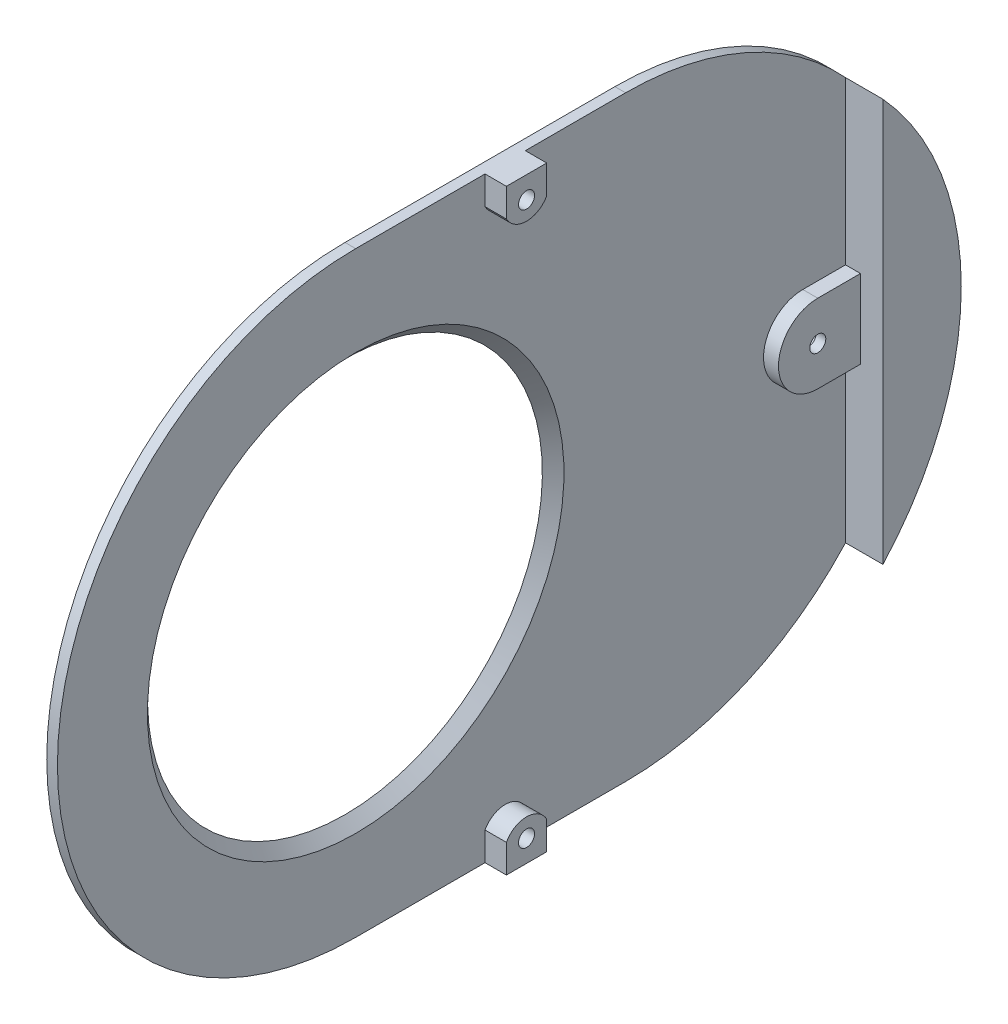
ISO-10303-21;
HEADER;
FILE_DESCRIPTION(('STEP AP214'),'2;1');
FILE_NAME('part.step','',(''),(''),'','','');
FILE_SCHEMA(('AUTOMOTIVE_DESIGN { 1 0 10303 214 1 1 1 1 }'));
ENDSEC;
DATA;
#1=APPLICATION_CONTEXT('core data for automotive mechanical design processes');
#2=APPLICATION_PROTOCOL_DEFINITION('international standard','automotive_design',2000,#1);
#3=PRODUCT_CONTEXT('',#1,'mechanical');
#4=PRODUCT('Part','Part','',(#3));
#5=PRODUCT_RELATED_PRODUCT_CATEGORY('part','',(#4));
#6=PRODUCT_DEFINITION_FORMATION('','',#4);
#7=PRODUCT_DEFINITION_CONTEXT('part definition',#1,'design');
#8=PRODUCT_DEFINITION('design','',#6,#7);
#9=PRODUCT_DEFINITION_SHAPE('','',#8);
#10=(LENGTH_UNIT() NAMED_UNIT(*) SI_UNIT(.MILLI.,.METRE.));
#11=(NAMED_UNIT(*) PLANE_ANGLE_UNIT() SI_UNIT($,.RADIAN.));
#12=(NAMED_UNIT(*) SI_UNIT($,.STERADIAN.) SOLID_ANGLE_UNIT());
#13=UNCERTAINTY_MEASURE_WITH_UNIT(LENGTH_MEASURE(1.E-05),#10,'distance_accuracy_value','');
#14=(GEOMETRIC_REPRESENTATION_CONTEXT(3) GLOBAL_UNCERTAINTY_ASSIGNED_CONTEXT((#13)) GLOBAL_UNIT_ASSIGNED_CONTEXT((#10,
#11,#12)) REPRESENTATION_CONTEXT('',''));
#15=CARTESIAN_POINT('',(0.,0.,0.));
#16=DIRECTION('',(0.,0.,1.));
#17=DIRECTION('',(1.,0.,0.));
#18=AXIS2_PLACEMENT_3D('',#15,#16,#17);
#19=CARTESIAN_POINT('',(-68.9,7.06668279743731,-66.1907413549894));
#20=DIRECTION('',(1.,0.,0.));
#21=DIRECTION('',(0.,1.,0.));
#22=AXIS2_PLACEMENT_3D('',#19,#20,#21);
#23=PLANE('',#22);
#24=CARTESIAN_POINT('',(-68.9,-50.9728934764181,-26.1696450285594));
#25=DIRECTION('',(-1.,0.,0.));
#26=DIRECTION('',(0.,-1.,0.));
#27=AXIS2_PLACEMENT_3D('',#24,#25,#26);
#28=CIRCLE('',#27,2.8);
#29=CARTESIAN_POINT('',(-68.9,-48.1728934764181,-26.1696450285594));
#30=VERTEX_POINT('',#29);
#31=EDGE_CURVE('E335',#30,#30,#28,.T.);
#32=ORIENTED_EDGE('',*,*,#31,.F.);
#33=EDGE_LOOP('',(#32));
#34=FACE_BOUND('',#33,.T.);
#35=CARTESIAN_POINT('',(-68.9,52.4551065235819,-26.1696450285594));
#36=DIRECTION('',(-1.,0.,0.));
#37=DIRECTION('',(0.,1.,0.));
#38=AXIS2_PLACEMENT_3D('',#35,#36,#37);
#39=CIRCLE('',#38,2.8);
#40=CARTESIAN_POINT('',(-68.9,49.6551065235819,-26.1696450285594));
#41=VERTEX_POINT('',#40);
#42=EDGE_CURVE('E382',#41,#41,#39,.T.);
#43=ORIENTED_EDGE('',*,*,#42,.F.);
#44=EDGE_LOOP('',(#43));
#45=FACE_BOUND('',#44,.T.);
#46=CARTESIAN_POINT('',(-68.9,0.741106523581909,-81.8452658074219));
#47=DIRECTION('',(-1.,0.,0.));
#48=DIRECTION('',(0.,-1.,0.));
#49=AXIS2_PLACEMENT_3D('',#46,#47,#48);
#50=CIRCLE('',#49,2.8);
#51=CARTESIAN_POINT('',(-68.9,3.54110652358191,-81.8452658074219));
#52=VERTEX_POINT('',#51);
#53=EDGE_CURVE('E365',#52,#52,#50,.T.);
#54=ORIENTED_EDGE('',*,*,#53,.F.);
#55=EDGE_LOOP('',(#54));
#56=FACE_BOUND('',#55,.T.);
#57=CARTESIAN_POINT('',(-68.9,0.741106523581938,1.79473419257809));
#58=DIRECTION('',(1.,0.,0.));
#59=DIRECTION('',(0.,-1.,0.));
#60=AXIS2_PLACEMENT_3D('',#57,#58,#59);
#61=CIRCLE('',#60,36.9219496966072);
#62=CARTESIAN_POINT('',(-68.9,-36.1808431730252,1.79473419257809));
#63=VERTEX_POINT('',#62);
#64=EDGE_CURVE('E27',#63,#63,#61,.T.);
#65=ORIENTED_EDGE('',*,*,#64,.T.);
#66=EDGE_LOOP('',(#65));
#67=FACE_BOUND('',#66,.T.);
#68=CARTESIAN_POINT('',(-68.9,0.741106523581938,-48.6952658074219));
#69=DIRECTION('',(1.,0.,0.));
#70=DIRECTION('',(0.,-1.,0.));
#71=AXIS2_PLACEMENT_3D('',#68,#69,#70);
#72=CIRCLE('',#71,55.794);
#73=CARTESIAN_POINT('',(-68.9,-55.0528934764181,-48.6952658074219));
#74=VERTEX_POINT('',#73);
#75=CARTESIAN_POINT('',(-68.9,56.5351065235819,-48.6952658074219));
#76=VERTEX_POINT('',#75);
#77=EDGE_CURVE('E11',#74,#76,#72,.T.);
#78=ORIENTED_EDGE('',*,*,#77,.F.);
#79=DIRECTION('',(0.,0.,-1.));
#80=VECTOR('',#79,1.);
#81=CARTESIAN_POINT('',(-68.9,-55.0528934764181,-10.8277658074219));
#82=LINE('',#81,#80);
#83=CARTESIAN_POINT('',(-68.9,-55.0528934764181,1.79473419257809));
#84=VERTEX_POINT('',#83);
#85=EDGE_CURVE('E404',#84,#74,#82,.T.);
#86=ORIENTED_EDGE('',*,*,#85,.F.);
#87=CARTESIAN_POINT('',(-68.9,0.741106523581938,1.79473419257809));
#88=DIRECTION('',(1.,0.,0.));
#89=DIRECTION('',(0.,-1.,0.));
#90=AXIS2_PLACEMENT_3D('',#87,#88,#89);
#91=CIRCLE('',#90,55.794);
#92=CARTESIAN_POINT('',(-68.9,56.5351065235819,1.79473419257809));
#93=VERTEX_POINT('',#92);
#94=EDGE_CURVE('E348',#93,#84,#91,.T.);
#95=ORIENTED_EDGE('',*,*,#94,.F.);
#96=DIRECTION('',(0.,0.,1.));
#97=VECTOR('',#96,1.);
#98=CARTESIAN_POINT('',(-68.9,56.5351065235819,-36.0727658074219));
#99=LINE('',#98,#97);
#100=EDGE_CURVE('E442',#76,#93,#99,.T.);
#101=ORIENTED_EDGE('',*,*,#100,.F.);
#102=EDGE_LOOP('',(#78,#86,#95,#101));
#103=FACE_BOUND('',#102,.T.);
#104=ADVANCED_FACE('F16',(#34,#45,#56,#67,#103),#23,.F.);
#105=CARTESIAN_POINT('',(-68.9,0.741106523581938,-48.6952658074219));
#106=DIRECTION('',(-1.,0.,0.));
#107=DIRECTION('',(0.,-1.,0.));
#108=AXIS2_PLACEMENT_3D('',#105,#106,#107);
#109=CYLINDRICAL_SURFACE('',#108,55.794);
#110=ORIENTED_EDGE('',*,*,#77,.T.);
#111=DIRECTION('',(-1.,0.,0.));
#112=VECTOR('',#111,1.);
#113=CARTESIAN_POINT('',(-66.9,56.5351065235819,-48.6952658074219));
#114=LINE('',#113,#112);
#115=CARTESIAN_POINT('',(-66.9,56.5351065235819,-48.6952658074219));
#116=VERTEX_POINT('',#115);
#117=EDGE_CURVE('E262',#116,#76,#114,.T.);
#118=ORIENTED_EDGE('',*,*,#117,.F.);
#119=CARTESIAN_POINT('',(-66.9,0.741106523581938,-48.6952658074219));
#120=DIRECTION('',(-1.,0.,0.));
#121=DIRECTION('',(0.,1.,0.));
#122=AXIS2_PLACEMENT_3D('',#119,#120,#121);
#123=CIRCLE('',#122,55.794);
#124=CARTESIAN_POINT('',(-66.9,38.4286646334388,-89.836709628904));
#125=VERTEX_POINT('',#124);
#126=EDGE_CURVE('E296',#116,#125,#123,.T.);
#127=ORIENTED_EDGE('',*,*,#126,.T.);
#128=DIRECTION('',(-1.,0.,0.));
#129=VECTOR('',#128,1.);
#130=CARTESIAN_POINT('',(-68.9,38.4286646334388,-89.836709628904));
#131=LINE('',#130,#129);
#132=CARTESIAN_POINT('',(-59.9,38.4286646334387,-89.836709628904));
#133=VERTEX_POINT('',#132);
#134=EDGE_CURVE('E20',#133,#125,#131,.T.);
#135=ORIENTED_EDGE('',*,*,#134,.F.);
#136=CARTESIAN_POINT('',(-59.9,0.741106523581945,-48.6952658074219));
#137=DIRECTION('',(-1.,0.,0.));
#138=DIRECTION('',(0.,0.683335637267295,-0.730104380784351));
#139=AXIS2_PLACEMENT_3D('',#136,#137,#138);
#140=CIRCLE('',#139,55.794);
#141=CARTESIAN_POINT('',(-59.9,-36.9464515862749,-89.836709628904));
#142=VERTEX_POINT('',#141);
#143=EDGE_CURVE('E244',#133,#142,#140,.T.);
#144=ORIENTED_EDGE('',*,*,#143,.T.);
#145=DIRECTION('',(-1.,0.,0.));
#146=VECTOR('',#145,1.);
#147=CARTESIAN_POINT('',(-68.9,-36.9464515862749,-89.836709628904));
#148=LINE('',#147,#146);
#149=CARTESIAN_POINT('',(-66.9,-36.9464515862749,-89.836709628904));
#150=VERTEX_POINT('',#149);
#151=EDGE_CURVE('E230',#142,#150,#148,.T.);
#152=ORIENTED_EDGE('',*,*,#151,.T.);
#153=CARTESIAN_POINT('',(-66.9,0.741106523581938,-48.6952658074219));
#154=DIRECTION('',(-1.,0.,0.));
#155=DIRECTION('',(0.,1.,0.));
#156=AXIS2_PLACEMENT_3D('',#153,#154,#155);
#157=CIRCLE('',#156,55.794);
#158=CARTESIAN_POINT('',(-66.9,-55.0528934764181,-48.6952658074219));
#159=VERTEX_POINT('',#158);
#160=EDGE_CURVE('E293',#150,#159,#157,.T.);
#161=ORIENTED_EDGE('',*,*,#160,.T.);
#162=DIRECTION('',(-1.,0.,0.));
#163=VECTOR('',#162,1.);
#164=CARTESIAN_POINT('',(-66.9,-55.0528934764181,-48.6952658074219));
#165=LINE('',#164,#163);
#166=EDGE_CURVE('E399',#159,#74,#165,.T.);
#167=ORIENTED_EDGE('',*,*,#166,.T.);
#168=EDGE_LOOP('',(#110,#118,#127,#135,#144,#152,#161,#167));
#169=FACE_BOUND('',#168,.T.);
#170=ADVANCED_FACE('F245',(#169),#109,.T.);
#171=CARTESIAN_POINT('',(-68.5,0.741106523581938,1.79473419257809));
#172=DIRECTION('',(1.,0.,0.));
#173=DIRECTION('',(0.,1.,0.));
#174=AXIS2_PLACEMENT_3D('',#171,#172,#173);
#175=CONICAL_SURFACE('',#174,37.3299496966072,0.795298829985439);
#176=CARTESIAN_POINT('',(-66.9,0.741106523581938,1.79473419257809));
#177=DIRECTION('',(-1.,0.,0.));
#178=DIRECTION('',(0.,1.,0.));
#179=AXIS2_PLACEMENT_3D('',#176,#177,#178);
#180=CIRCLE('',#179,38.9619496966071);
#181=CARTESIAN_POINT('',(-66.9,-38.2208431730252,1.79473419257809));
#182=VERTEX_POINT('',#181);
#183=EDGE_CURVE('E302',#182,#182,#180,.T.);
#184=ORIENTED_EDGE('',*,*,#183,.F.);
#185=DIRECTION('',(-0.700071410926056,0.714072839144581,0.));
#186=VECTOR('',#185,1.);
#187=CARTESIAN_POINT('',(-68.5,-36.5888431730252,1.79473419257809));
#188=LINE('',#187,#186);
#189=EDGE_CURVE('E368',#182,#63,#188,.T.);
#190=ORIENTED_EDGE('',*,*,#189,.T.);
#191=ORIENTED_EDGE('',*,*,#64,.F.);
#192=ORIENTED_EDGE('',*,*,#189,.F.);
#193=EDGE_LOOP('',(#184,#190,#191,#192));
#194=FACE_BOUND('',#193,.T.);
#195=ADVANCED_FACE('F843',(#194),#175,.F.);
#196=CARTESIAN_POINT('',(-59.9,38.8671350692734,-89.836709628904));
#197=DIRECTION('',(0.,0.,-1.));
#198=DIRECTION('',(0.,-1.,0.));
#199=AXIS2_PLACEMENT_3D('',#196,#197,#198);
#200=PLANE('',#199);
#201=DIRECTION('',(-1.,0.,0.));
#202=VECTOR('',#201,1.);
#203=CARTESIAN_POINT('',(-63.4,8.08710652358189,-89.836709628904));
#204=LINE('',#203,#202);
#205=CARTESIAN_POINT('',(-64.1,8.08710652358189,-89.836709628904));
#206=VERTEX_POINT('',#205);
#207=CARTESIAN_POINT('',(-66.9,8.08710652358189,-89.836709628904));
#208=VERTEX_POINT('',#207);
#209=EDGE_CURVE('E265',#206,#208,#204,.T.);
#210=ORIENTED_EDGE('',*,*,#209,.F.);
#211=DIRECTION('',(0.,1.,0.));
#212=VECTOR('',#211,1.);
#213=CARTESIAN_POINT('',(-64.1,19.8041207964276,-89.836709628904));
#214=LINE('',#213,#212);
#215=CARTESIAN_POINT('',(-64.1,-6.60489347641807,-89.836709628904));
#216=VERTEX_POINT('',#215);
#217=EDGE_CURVE('E241',#216,#206,#214,.T.);
#218=ORIENTED_EDGE('',*,*,#217,.F.);
#219=DIRECTION('',(1.,0.,0.));
#220=VECTOR('',#219,1.);
#221=CARTESIAN_POINT('',(-63.4,-6.60489347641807,-89.836709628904));
#222=LINE('',#221,#220);
#223=CARTESIAN_POINT('',(-66.9,-6.60489347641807,-89.836709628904));
#224=VERTEX_POINT('',#223);
#225=EDGE_CURVE('E307',#224,#216,#222,.T.);
#226=ORIENTED_EDGE('',*,*,#225,.F.);
#227=DIRECTION('',(0.,-1.,0.));
#228=VECTOR('',#227,1.);
#229=CARTESIAN_POINT('',(-66.9,19.8041207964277,-89.836709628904));
#230=LINE('',#229,#228);
#231=EDGE_CURVE('E237',#224,#150,#230,.T.);
#232=ORIENTED_EDGE('',*,*,#231,.T.);
#233=ORIENTED_EDGE('',*,*,#151,.F.);
#234=DIRECTION('',(0.,1.,0.));
#235=VECTOR('',#234,1.);
#236=CARTESIAN_POINT('',(-59.9,19.8041207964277,-89.836709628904));
#237=LINE('',#236,#235);
#238=EDGE_CURVE('E235',#142,#133,#237,.T.);
#239=ORIENTED_EDGE('',*,*,#238,.T.);
#240=ORIENTED_EDGE('',*,*,#134,.T.);
#241=DIRECTION('',(0.,-1.,0.));
#242=VECTOR('',#241,1.);
#243=CARTESIAN_POINT('',(-66.9,19.8041207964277,-89.836709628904));
#244=LINE('',#243,#242);
#245=EDGE_CURVE('E353',#125,#208,#244,.T.);
#246=ORIENTED_EDGE('',*,*,#245,.T.);
#247=EDGE_LOOP('',(#210,#218,#226,#232,#233,#239,#240,#246));
#248=FACE_BOUND('',#247,.T.);
#249=ADVANCED_FACE('F233',(#248),#200,.F.);
#250=CARTESIAN_POINT('',(-64.1,0.741106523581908,-81.8452658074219));
#251=DIRECTION('',(1.,0.,0.));
#252=DIRECTION('',(0.,1.,0.));
#253=AXIS2_PLACEMENT_3D('',#250,#251,#252);
#254=PLANE('',#253);
#255=CARTESIAN_POINT('',(-64.1,0.741106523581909,-81.8452658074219));
#256=DIRECTION('',(1.,0.,0.));
#257=DIRECTION('',(0.,-1.,0.));
#258=AXIS2_PLACEMENT_3D('',#255,#256,#257);
#259=CIRCLE('',#258,1.5);
#260=CARTESIAN_POINT('',(-64.1,2.24110652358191,-81.8452658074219));
#261=VERTEX_POINT('',#260);
#262=EDGE_CURVE('E403',#261,#261,#259,.T.);
#263=ORIENTED_EDGE('',*,*,#262,.F.);
#264=EDGE_LOOP('',(#263));
#265=FACE_BOUND('',#264,.T.);
#266=ORIENTED_EDGE('',*,*,#217,.T.);
#267=DIRECTION('',(0.,0.,-1.));
#268=VECTOR('',#267,1.);
#269=CARTESIAN_POINT('',(-64.1,8.08710652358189,-81.8452658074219));
#270=LINE('',#269,#268);
#271=CARTESIAN_POINT('',(-64.1,8.08710652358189,-81.8452658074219));
#272=VERTEX_POINT('',#271);
#273=EDGE_CURVE('E277',#272,#206,#270,.T.);
#274=ORIENTED_EDGE('',*,*,#273,.F.);
#275=CARTESIAN_POINT('',(-64.1,0.741106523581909,-81.8452658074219));
#276=DIRECTION('',(-1.,0.,0.));
#277=DIRECTION('',(0.,-1.,0.));
#278=AXIS2_PLACEMENT_3D('',#275,#276,#277);
#279=CIRCLE('',#278,7.346);
#280=CARTESIAN_POINT('',(-64.1,-6.60489347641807,-81.8452658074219));
#281=VERTEX_POINT('',#280);
#282=EDGE_CURVE('E299',#281,#272,#279,.T.);
#283=ORIENTED_EDGE('',*,*,#282,.F.);
#284=DIRECTION('',(0.,0.,1.));
#285=VECTOR('',#284,1.);
#286=CARTESIAN_POINT('',(-64.1,-6.60489347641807,-85.6702658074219));
#287=LINE('',#286,#285);
#288=EDGE_CURVE('E303',#216,#281,#287,.T.);
#289=ORIENTED_EDGE('',*,*,#288,.F.);
#290=EDGE_LOOP('',(#266,#274,#283,#289));
#291=FACE_BOUND('',#290,.T.);
#292=ADVANCED_FACE('F842',(#265,#291),#254,.T.);
#293=CARTESIAN_POINT('',(-66.9,0.741106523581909,-81.8452658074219));
#294=DIRECTION('',(-1.,0.,0.));
#295=DIRECTION('',(0.,-1.,0.));
#296=AXIS2_PLACEMENT_3D('',#293,#294,#295);
#297=CYLINDRICAL_SURFACE('',#296,7.346);
#298=CARTESIAN_POINT('',(-66.9,0.741106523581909,-81.8452658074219));
#299=DIRECTION('',(1.,0.,0.));
#300=DIRECTION('',(0.,-1.,0.));
#301=AXIS2_PLACEMENT_3D('',#298,#299,#300);
#302=CIRCLE('',#301,7.346);
#303=CARTESIAN_POINT('',(-66.9,8.08710652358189,-81.8452658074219));
#304=VERTEX_POINT('',#303);
#305=CARTESIAN_POINT('',(-66.9,-6.60489347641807,-81.8452658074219));
#306=VERTEX_POINT('',#305);
#307=EDGE_CURVE('E249',#304,#306,#302,.T.);
#308=ORIENTED_EDGE('',*,*,#307,.T.);
#309=DIRECTION('',(1.,0.,0.));
#310=VECTOR('',#309,1.);
#311=CARTESIAN_POINT('',(-66.9,-6.60489347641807,-81.8452658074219));
#312=LINE('',#311,#310);
#313=EDGE_CURVE('E259',#306,#281,#312,.T.);
#314=ORIENTED_EDGE('',*,*,#313,.T.);
#315=ORIENTED_EDGE('',*,*,#282,.T.);
#316=DIRECTION('',(1.,0.,0.));
#317=VECTOR('',#316,1.);
#318=CARTESIAN_POINT('',(-66.9,8.08710652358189,-81.8452658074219));
#319=LINE('',#318,#317);
#320=EDGE_CURVE('E282',#304,#272,#319,.T.);
#321=ORIENTED_EDGE('',*,*,#320,.F.);
#322=EDGE_LOOP('',(#308,#314,#315,#321));
#323=FACE_BOUND('',#322,.T.);
#324=ADVANCED_FACE('F908',(#323),#297,.T.);
#325=CARTESIAN_POINT('',(-66.9,0.741106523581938,-23.4502658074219));
#326=DIRECTION('',(1.,0.,0.));
#327=DIRECTION('',(0.,1.,0.));
#328=AXIS2_PLACEMENT_3D('',#325,#326,#327);
#329=PLANE('',#328);
#330=ORIENTED_EDGE('',*,*,#183,.T.);
#331=EDGE_LOOP('',(#330));
#332=FACE_BOUND('',#331,.T.);
#333=DIRECTION('',(0.,0.,-1.));
#334=VECTOR('',#333,1.);
#335=CARTESIAN_POINT('',(-66.9,-6.60489347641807,-56.4727658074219));
#336=LINE('',#335,#334);
#337=EDGE_CURVE('E253',#306,#224,#336,.T.);
#338=ORIENTED_EDGE('',*,*,#337,.F.);
#339=ORIENTED_EDGE('',*,*,#307,.F.);
#340=DIRECTION('',(0.,0.,1.));
#341=VECTOR('',#340,1.);
#342=CARTESIAN_POINT('',(-66.9,8.08710652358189,-52.6477658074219));
#343=LINE('',#342,#341);
#344=EDGE_CURVE('E269',#208,#304,#343,.T.);
#345=ORIENTED_EDGE('',*,*,#344,.F.);
#346=ORIENTED_EDGE('',*,*,#245,.F.);
#347=ORIENTED_EDGE('',*,*,#126,.F.);
#348=DIRECTION('',(0.,0.,-1.));
#349=VECTOR('',#348,1.);
#350=CARTESIAN_POINT('',(-66.9,56.5351065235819,-36.0727658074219));
#351=LINE('',#350,#349);
#352=CARTESIAN_POINT('',(-66.9,56.5351065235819,-29.9402728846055));
#353=VERTEX_POINT('',#352);
#354=EDGE_CURVE('E427',#353,#116,#351,.T.);
#355=ORIENTED_EDGE('',*,*,#354,.F.);
#356=DIRECTION('',(0.,1.,0.));
#357=VECTOR('',#356,1.);
#358=CARTESIAN_POINT('',(-66.9,28.6381065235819,-29.9402728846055));
#359=LINE('',#358,#357);
#360=CARTESIAN_POINT('',(-66.9,51.2334211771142,-29.9402728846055));
#361=VERTEX_POINT('',#360);
#362=EDGE_CURVE('E381',#361,#353,#359,.T.);
#363=ORIENTED_EDGE('',*,*,#362,.F.);
#364=CARTESIAN_POINT('',(-66.9,53.2711065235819,-26.1696450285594));
#365=DIRECTION('',(1.,0.,0.));
#366=DIRECTION('',(0.,1.,0.));
#367=AXIS2_PLACEMENT_3D('',#364,#365,#366);
#368=CIRCLE('',#367,4.286);
#369=CARTESIAN_POINT('',(-66.9,51.2334211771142,-22.3990171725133));
#370=VERTEX_POINT('',#369);
#371=EDGE_CURVE('E393',#370,#361,#368,.T.);
#372=ORIENTED_EDGE('',*,*,#371,.F.);
#373=DIRECTION('',(0.,-1.,0.));
#374=VECTOR('',#373,1.);
#375=CARTESIAN_POINT('',(-66.9,27.1081065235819,-22.3990171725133));
#376=LINE('',#375,#374);
#377=CARTESIAN_POINT('',(-66.9,56.5351065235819,-22.3990171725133));
#378=VERTEX_POINT('',#377);
#379=EDGE_CURVE('E311',#378,#370,#376,.T.);
#380=ORIENTED_EDGE('',*,*,#379,.F.);
#381=DIRECTION('',(0.,0.,-1.));
#382=VECTOR('',#381,1.);
#383=CARTESIAN_POINT('',(-66.9,56.5351065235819,-36.0727658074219));
#384=LINE('',#383,#382);
#385=CARTESIAN_POINT('',(-66.9,56.5351065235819,1.79473419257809));
#386=VERTEX_POINT('',#385);
#387=EDGE_CURVE('E315',#386,#378,#384,.T.);
#388=ORIENTED_EDGE('',*,*,#387,.F.);
#389=CARTESIAN_POINT('',(-66.9,0.741106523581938,1.79473419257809));
#390=DIRECTION('',(-1.,0.,0.));
#391=DIRECTION('',(0.,-1.,0.));
#392=AXIS2_PLACEMENT_3D('',#389,#390,#391);
#393=CIRCLE('',#392,55.794);
#394=CARTESIAN_POINT('',(-66.9,-55.0528934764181,1.79473419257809));
#395=VERTEX_POINT('',#394);
#396=EDGE_CURVE('E398',#395,#386,#393,.T.);
#397=ORIENTED_EDGE('',*,*,#396,.F.);
#398=DIRECTION('',(0.,0.,1.));
#399=VECTOR('',#398,1.);
#400=CARTESIAN_POINT('',(-66.9,-55.0528934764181,-10.8277658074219));
#401=LINE('',#400,#399);
#402=CARTESIAN_POINT('',(-66.9,-55.0528934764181,-22.3990171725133));
#403=VERTEX_POINT('',#402);
#404=EDGE_CURVE('E361',#403,#395,#401,.T.);
#405=ORIENTED_EDGE('',*,*,#404,.F.);
#406=DIRECTION('',(0.,-1.,0.));
#407=VECTOR('',#406,1.);
#408=CARTESIAN_POINT('',(-66.9,-25.6258934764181,-22.3990171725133));
#409=LINE('',#408,#407);
#410=CARTESIAN_POINT('',(-66.9,-49.7512081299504,-22.3990171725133));
#411=VERTEX_POINT('',#410);
#412=EDGE_CURVE('E324',#411,#403,#409,.T.);
#413=ORIENTED_EDGE('',*,*,#412,.F.);
#414=CARTESIAN_POINT('',(-66.9,-51.7888934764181,-26.1696450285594));
#415=DIRECTION('',(1.,0.,0.));
#416=DIRECTION('',(0.,-1.,0.));
#417=AXIS2_PLACEMENT_3D('',#414,#415,#416);
#418=CIRCLE('',#417,4.286);
#419=CARTESIAN_POINT('',(-66.9,-49.7512081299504,-29.9402728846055));
#420=VERTEX_POINT('',#419);
#421=EDGE_CURVE('E330',#420,#411,#418,.T.);
#422=ORIENTED_EDGE('',*,*,#421,.F.);
#423=DIRECTION('',(0.,1.,0.));
#424=VECTOR('',#423,1.);
#425=CARTESIAN_POINT('',(-66.9,-27.1558934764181,-29.9402728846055));
#426=LINE('',#425,#424);
#427=CARTESIAN_POINT('',(-66.9,-55.0528934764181,-29.9402728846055));
#428=VERTEX_POINT('',#427);
#429=EDGE_CURVE('E349',#428,#420,#426,.T.);
#430=ORIENTED_EDGE('',*,*,#429,.F.);
#431=DIRECTION('',(0.,0.,1.));
#432=VECTOR('',#431,1.);
#433=CARTESIAN_POINT('',(-66.9,-55.0528934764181,-10.8277658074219));
#434=LINE('',#433,#432);
#435=EDGE_CURVE('E352',#159,#428,#434,.T.);
#436=ORIENTED_EDGE('',*,*,#435,.F.);
#437=ORIENTED_EDGE('',*,*,#160,.F.);
#438=ORIENTED_EDGE('',*,*,#231,.F.);
#439=EDGE_LOOP('',(#338,#339,#345,#346,#347,#355,#363,#372,#380,#388,#397,#405,#413,#422,#430,
#436,#437,#438));
#440=FACE_BOUND('',#439,.T.);
#441=ADVANCED_FACE('F460',(#332,#440),#329,.T.);
#442=CARTESIAN_POINT('',(-59.9,0.741106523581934,-96.9599877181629));
#443=DIRECTION('',(-1.,0.,0.));
#444=DIRECTION('',(0.,0.,1.));
#445=AXIS2_PLACEMENT_3D('',#442,#443,#444);
#446=PLANE('',#445);
#447=ORIENTED_EDGE('',*,*,#238,.F.);
#448=ORIENTED_EDGE('',*,*,#143,.F.);
#449=EDGE_LOOP('',(#447,#448));
#450=FACE_BOUND('',#449,.T.);
#451=ADVANCED_FACE('F251',(#450),#446,.F.);
#452=CARTESIAN_POINT('',(-66.9,-6.60489347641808,-89.4952658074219));
#453=DIRECTION('',(0.,1.,0.));
#454=DIRECTION('',(0.,0.,-1.));
#455=AXIS2_PLACEMENT_3D('',#452,#453,#454);
#456=PLANE('',#455);
#457=ORIENTED_EDGE('',*,*,#225,.T.);
#458=ORIENTED_EDGE('',*,*,#288,.T.);
#459=ORIENTED_EDGE('',*,*,#313,.F.);
#460=ORIENTED_EDGE('',*,*,#337,.T.);
#461=EDGE_LOOP('',(#457,#458,#459,#460));
#462=FACE_BOUND('',#461,.T.);
#463=ADVANCED_FACE('F809',(#462),#456,.F.);
#464=CARTESIAN_POINT('',(-66.9,0.741106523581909,-81.8452658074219));
#465=DIRECTION('',(-1.,0.,0.));
#466=DIRECTION('',(0.,-1.,0.));
#467=AXIS2_PLACEMENT_3D('',#464,#465,#466);
#468=CYLINDRICAL_SURFACE('',#467,1.5);
#469=ORIENTED_EDGE('',*,*,#262,.T.);
#470=DIRECTION('',(-1.,0.,0.));
#471=VECTOR('',#470,1.);
#472=CARTESIAN_POINT('',(-66.9,2.24110652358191,-81.8452658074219));
#473=LINE('',#472,#471);
#474=CARTESIAN_POINT('',(-65.9,2.24110652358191,-81.8452658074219));
#475=VERTEX_POINT('',#474);
#476=EDGE_CURVE('E431',#261,#475,#473,.T.);
#477=ORIENTED_EDGE('',*,*,#476,.T.);
#478=CARTESIAN_POINT('',(-65.9,0.741106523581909,-81.8452658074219));
#479=DIRECTION('',(1.,0.,0.));
#480=DIRECTION('',(0.,-1.,0.));
#481=AXIS2_PLACEMENT_3D('',#478,#479,#480);
#482=CIRCLE('',#481,1.5);
#483=EDGE_CURVE('E270',#475,#475,#482,.T.);
#484=ORIENTED_EDGE('',*,*,#483,.F.);
#485=ORIENTED_EDGE('',*,*,#476,.F.);
#486=EDGE_LOOP('',(#469,#477,#484,#485));
#487=FACE_BOUND('',#486,.T.);
#488=ADVANCED_FACE('F818',(#487),#468,.F.);
#489=CARTESIAN_POINT('',(-66.9,-55.0528934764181,1.79473419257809));
#490=DIRECTION('',(0.,1.,0.));
#491=DIRECTION('',(1.,0.,0.));
#492=AXIS2_PLACEMENT_3D('',#489,#490,#491);
#493=PLANE('',#492);
#494=ORIENTED_EDGE('',*,*,#435,.T.);
#495=DIRECTION('',(-1.,0.,0.));
#496=VECTOR('',#495,1.);
#497=CARTESIAN_POINT('',(-64.9,-55.0528934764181,-29.9402728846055));
#498=LINE('',#497,#496);
#499=CARTESIAN_POINT('',(-62.9,-55.0528934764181,-29.9402728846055));
#500=VERTEX_POINT('',#499);
#501=EDGE_CURVE('E333',#500,#428,#498,.T.);
#502=ORIENTED_EDGE('',*,*,#501,.F.);
#503=DIRECTION('',(0.,0.,1.));
#504=VECTOR('',#503,1.);
#505=CARTESIAN_POINT('',(-62.9,-55.0528934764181,-12.1874554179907));
#506=LINE('',#505,#504);
#507=CARTESIAN_POINT('',(-62.9,-55.0528934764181,-22.3990171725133));
#508=VERTEX_POINT('',#507);
#509=EDGE_CURVE('E438',#500,#508,#506,.T.);
#510=ORIENTED_EDGE('',*,*,#509,.T.);
#511=DIRECTION('',(-1.,0.,0.));
#512=VECTOR('',#511,1.);
#513=CARTESIAN_POINT('',(-64.9,-55.0528934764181,-22.3990171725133));
#514=LINE('',#513,#512);
#515=EDGE_CURVE('E344',#508,#403,#514,.T.);
#516=ORIENTED_EDGE('',*,*,#515,.T.);
#517=ORIENTED_EDGE('',*,*,#404,.T.);
#518=DIRECTION('',(-1.,0.,0.));
#519=VECTOR('',#518,1.);
#520=CARTESIAN_POINT('',(-66.9,-55.0528934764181,1.79473419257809));
#521=LINE('',#520,#519);
#522=EDGE_CURVE('E325',#395,#84,#521,.T.);
#523=ORIENTED_EDGE('',*,*,#522,.T.);
#524=ORIENTED_EDGE('',*,*,#85,.T.);
#525=ORIENTED_EDGE('',*,*,#166,.F.);
#526=EDGE_LOOP('',(#494,#502,#510,#516,#517,#523,#524,#525));
#527=FACE_BOUND('',#526,.T.);
#528=ADVANCED_FACE('F663',(#527),#493,.F.);
#529=CARTESIAN_POINT('',(-62.9,-55.052893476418,-29.9402728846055));
#530=DIRECTION('',(0.,0.,1.));
#531=DIRECTION('',(1.,0.,0.));
#532=AXIS2_PLACEMENT_3D('',#529,#530,#531);
#533=PLANE('',#532);
#534=DIRECTION('',(0.,-1.,0.));
#535=VECTOR('',#534,1.);
#536=CARTESIAN_POINT('',(-62.9,-53.2678934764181,-29.9402728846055));
#537=LINE('',#536,#535);
#538=CARTESIAN_POINT('',(-62.9,-49.7512081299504,-29.9402728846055));
#539=VERTEX_POINT('',#538);
#540=EDGE_CURVE('E590',#539,#500,#537,.T.);
#541=ORIENTED_EDGE('',*,*,#540,.T.);
#542=ORIENTED_EDGE('',*,*,#501,.T.);
#543=ORIENTED_EDGE('',*,*,#429,.T.);
#544=DIRECTION('',(1.,0.,0.));
#545=VECTOR('',#544,1.);
#546=CARTESIAN_POINT('',(-62.9,-49.7512081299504,-29.9402728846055));
#547=LINE('',#546,#545);
#548=EDGE_CURVE('E334',#420,#539,#547,.T.);
#549=ORIENTED_EDGE('',*,*,#548,.T.);
#550=EDGE_LOOP('',(#541,#542,#543,#549));
#551=FACE_BOUND('',#550,.T.);
#552=ADVANCED_FACE('F674',(#551),#533,.F.);
#553=CARTESIAN_POINT('',(-62.9,-51.7888934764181,-26.1696450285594));
#554=DIRECTION('',(-1.,0.,0.));
#555=DIRECTION('',(0.,1.,0.));
#556=AXIS2_PLACEMENT_3D('',#553,#554,#555);
#557=CYLINDRICAL_SURFACE('',#556,4.286);
#558=DIRECTION('',(-1.,0.,0.));
#559=VECTOR('',#558,1.);
#560=CARTESIAN_POINT('',(-62.9,-49.7512081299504,-22.3990171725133));
#561=LINE('',#560,#559);
#562=CARTESIAN_POINT('',(-62.9,-49.7512081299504,-22.3990171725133));
#563=VERTEX_POINT('',#562);
#564=EDGE_CURVE('E320',#563,#411,#561,.T.);
#565=ORIENTED_EDGE('',*,*,#564,.F.);
#566=CARTESIAN_POINT('',(-62.9,-51.7888934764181,-26.1696450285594));
#567=DIRECTION('',(-1.,0.,0.));
#568=DIRECTION('',(0.,-1.,0.));
#569=AXIS2_PLACEMENT_3D('',#566,#567,#568);
#570=CIRCLE('',#569,4.286);
#571=EDGE_CURVE('E586',#563,#539,#570,.T.);
#572=ORIENTED_EDGE('',*,*,#571,.T.);
#573=ORIENTED_EDGE('',*,*,#548,.F.);
#574=ORIENTED_EDGE('',*,*,#421,.T.);
#575=EDGE_LOOP('',(#565,#572,#573,#574));
#576=FACE_BOUND('',#575,.T.);
#577=ADVANCED_FACE('F893',(#576),#557,.T.);
#578=CARTESIAN_POINT('',(-62.9,-51.9928934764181,-22.3990171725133));
#579=DIRECTION('',(0.,0.,-1.));
#580=DIRECTION('',(0.,-1.,0.));
#581=AXIS2_PLACEMENT_3D('',#578,#579,#580);
#582=PLANE('',#581);
#583=DIRECTION('',(0.,1.,0.));
#584=VECTOR('',#583,1.);
#585=CARTESIAN_POINT('',(-62.9,-51.7378934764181,-22.3990171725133));
#586=LINE('',#585,#584);
#587=EDGE_CURVE('E434',#508,#563,#586,.T.);
#588=ORIENTED_EDGE('',*,*,#587,.T.);
#589=ORIENTED_EDGE('',*,*,#564,.T.);
#590=ORIENTED_EDGE('',*,*,#412,.T.);
#591=ORIENTED_EDGE('',*,*,#515,.F.);
#592=EDGE_LOOP('',(#588,#589,#590,#591));
#593=FACE_BOUND('',#592,.T.);
#594=ADVANCED_FACE('F680',(#593),#582,.F.);
#595=CARTESIAN_POINT('',(-66.9,0.741106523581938,1.79473419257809));
#596=DIRECTION('',(-1.,0.,0.));
#597=DIRECTION('',(0.,-1.,0.));
#598=AXIS2_PLACEMENT_3D('',#595,#596,#597);
#599=CYLINDRICAL_SURFACE('',#598,55.794);
#600=ORIENTED_EDGE('',*,*,#396,.T.);
#601=DIRECTION('',(-1.,0.,0.));
#602=VECTOR('',#601,1.);
#603=CARTESIAN_POINT('',(-66.9,56.5351065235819,1.79473419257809));
#604=LINE('',#603,#602);
#605=EDGE_CURVE('E446',#386,#93,#604,.T.);
#606=ORIENTED_EDGE('',*,*,#605,.T.);
#607=ORIENTED_EDGE('',*,*,#94,.T.);
#608=ORIENTED_EDGE('',*,*,#522,.F.);
#609=EDGE_LOOP('',(#600,#606,#607,#608));
#610=FACE_BOUND('',#609,.T.);
#611=ADVANCED_FACE('F684',(#610),#599,.T.);
#612=CARTESIAN_POINT('',(-66.9,56.5351065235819,-48.6952658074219));
#613=DIRECTION('',(0.,-1.,0.));
#614=DIRECTION('',(0.,0.,-1.));
#615=AXIS2_PLACEMENT_3D('',#612,#613,#614);
#616=PLANE('',#615);
#617=ORIENTED_EDGE('',*,*,#387,.T.);
#618=DIRECTION('',(-1.,0.,0.));
#619=VECTOR('',#618,1.);
#620=CARTESIAN_POINT('',(-64.9,56.5351065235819,-22.3990171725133));
#621=LINE('',#620,#619);
#622=CARTESIAN_POINT('',(-62.9,56.5351065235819,-22.3990171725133));
#623=VERTEX_POINT('',#622);
#624=EDGE_CURVE('E316',#623,#378,#621,.T.);
#625=ORIENTED_EDGE('',*,*,#624,.F.);
#626=DIRECTION('',(0.,0.,1.));
#627=VECTOR('',#626,1.);
#628=CARTESIAN_POINT('',(-62.9,56.5351065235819,-12.1874554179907));
#629=LINE('',#628,#627);
#630=CARTESIAN_POINT('',(-62.9,56.5351065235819,-29.9402728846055));
#631=VERTEX_POINT('',#630);
#632=EDGE_CURVE('E271',#631,#623,#629,.T.);
#633=ORIENTED_EDGE('',*,*,#632,.F.);
#634=DIRECTION('',(-1.,0.,0.));
#635=VECTOR('',#634,1.);
#636=CARTESIAN_POINT('',(-64.9,56.5351065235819,-29.9402728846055));
#637=LINE('',#636,#635);
#638=EDGE_CURVE('E372',#631,#353,#637,.T.);
#639=ORIENTED_EDGE('',*,*,#638,.T.);
#640=ORIENTED_EDGE('',*,*,#354,.T.);
#641=ORIENTED_EDGE('',*,*,#117,.T.);
#642=ORIENTED_EDGE('',*,*,#100,.T.);
#643=ORIENTED_EDGE('',*,*,#605,.F.);
#644=EDGE_LOOP('',(#617,#625,#633,#639,#640,#641,#642,#643));
#645=FACE_BOUND('',#644,.T.);
#646=ADVANCED_FACE('F689',(#645),#616,.F.);
#647=CARTESIAN_POINT('',(-62.9,53.4751065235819,-22.3990171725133));
#648=DIRECTION('',(0.,0.,-1.));
#649=DIRECTION('',(0.,-1.,0.));
#650=AXIS2_PLACEMENT_3D('',#647,#648,#649);
#651=PLANE('',#650);
#652=DIRECTION('',(0.,1.,0.));
#653=VECTOR('',#652,1.);
#654=CARTESIAN_POINT('',(-62.9,53.2201065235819,-22.3990171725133));
#655=LINE('',#654,#653);
#656=CARTESIAN_POINT('',(-62.9,51.2334211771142,-22.3990171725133));
#657=VERTEX_POINT('',#656);
#658=EDGE_CURVE('E319',#657,#623,#655,.T.);
#659=ORIENTED_EDGE('',*,*,#658,.T.);
#660=ORIENTED_EDGE('',*,*,#624,.T.);
#661=ORIENTED_EDGE('',*,*,#379,.T.);
#662=DIRECTION('',(1.,0.,0.));
#663=VECTOR('',#662,1.);
#664=CARTESIAN_POINT('',(-62.9,51.2334211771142,-22.3990171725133));
#665=LINE('',#664,#663);
#666=EDGE_CURVE('E389',#370,#657,#665,.T.);
#667=ORIENTED_EDGE('',*,*,#666,.T.);
#668=EDGE_LOOP('',(#659,#660,#661,#667));
#669=FACE_BOUND('',#668,.T.);
#670=ADVANCED_FACE('F698',(#669),#651,.F.);
#671=CARTESIAN_POINT('',(-62.9,56.5351065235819,-29.9402728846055));
#672=DIRECTION('',(0.,0.,1.));
#673=DIRECTION('',(1.,0.,0.));
#674=AXIS2_PLACEMENT_3D('',#671,#672,#673);
#675=PLANE('',#674);
#676=DIRECTION('',(0.,-1.,0.));
#677=VECTOR('',#676,1.);
#678=CARTESIAN_POINT('',(-62.9,54.7501065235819,-29.9402728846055));
#679=LINE('',#678,#677);
#680=CARTESIAN_POINT('',(-62.9,51.2334211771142,-29.9402728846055));
#681=VERTEX_POINT('',#680);
#682=EDGE_CURVE('E276',#631,#681,#679,.T.);
#683=ORIENTED_EDGE('',*,*,#682,.T.);
#684=DIRECTION('',(-1.,0.,0.));
#685=VECTOR('',#684,1.);
#686=CARTESIAN_POINT('',(-62.9,51.2334211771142,-29.9402728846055));
#687=LINE('',#686,#685);
#688=EDGE_CURVE('E574',#681,#361,#687,.T.);
#689=ORIENTED_EDGE('',*,*,#688,.T.);
#690=ORIENTED_EDGE('',*,*,#362,.T.);
#691=ORIENTED_EDGE('',*,*,#638,.F.);
#692=EDGE_LOOP('',(#683,#689,#690,#691));
#693=FACE_BOUND('',#692,.T.);
#694=ADVANCED_FACE('F692',(#693),#675,.F.);
#695=CARTESIAN_POINT('',(-68.9,52.4551065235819,-26.1696450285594));
#696=DIRECTION('',(-1.,0.,0.));
#697=DIRECTION('',(0.,1.,0.));
#698=AXIS2_PLACEMENT_3D('',#695,#696,#697);
#699=CYLINDRICAL_SURFACE('',#698,2.8);
#700=ORIENTED_EDGE('',*,*,#42,.T.);
#701=DIRECTION('',(1.,0.,0.));
#702=VECTOR('',#701,1.);
#703=CARTESIAN_POINT('',(-68.9,49.6551065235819,-26.1696450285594));
#704=LINE('',#703,#702);
#705=CARTESIAN_POINT('',(-65.9,49.6551065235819,-26.1696450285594));
#706=VERTEX_POINT('',#705);
#707=EDGE_CURVE('E378',#41,#706,#704,.T.);
#708=ORIENTED_EDGE('',*,*,#707,.T.);
#709=CARTESIAN_POINT('',(-65.9,52.4551065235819,-26.1696450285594));
#710=DIRECTION('',(1.,0.,0.));
#711=DIRECTION('',(0.,1.,0.));
#712=AXIS2_PLACEMENT_3D('',#709,#710,#711);
#713=CIRCLE('',#712,2.8);
#714=EDGE_CURVE('E287',#706,#706,#713,.T.);
#715=ORIENTED_EDGE('',*,*,#714,.T.);
#716=ORIENTED_EDGE('',*,*,#707,.F.);
#717=EDGE_LOOP('',(#700,#708,#715,#716));
#718=FACE_BOUND('',#717,.T.);
#719=ADVANCED_FACE('F887',(#718),#699,.F.);
#720=CARTESIAN_POINT('',(-68.9,-50.9728934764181,-26.1696450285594));
#721=DIRECTION('',(-1.,0.,0.));
#722=DIRECTION('',(0.,-1.,0.));
#723=AXIS2_PLACEMENT_3D('',#720,#721,#722);
#724=CYLINDRICAL_SURFACE('',#723,2.8);
#725=ORIENTED_EDGE('',*,*,#31,.T.);
#726=DIRECTION('',(1.,0.,0.));
#727=VECTOR('',#726,1.);
#728=CARTESIAN_POINT('',(-68.9,-48.1728934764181,-26.1696450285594));
#729=LINE('',#728,#727);
#730=CARTESIAN_POINT('',(-65.9,-48.1728934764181,-26.1696450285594));
#731=VERTEX_POINT('',#730);
#732=EDGE_CURVE('E339',#30,#731,#729,.T.);
#733=ORIENTED_EDGE('',*,*,#732,.T.);
#734=CARTESIAN_POINT('',(-65.9,-50.9728934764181,-26.1696450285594));
#735=DIRECTION('',(-1.,0.,0.));
#736=DIRECTION('',(0.,-1.,0.));
#737=AXIS2_PLACEMENT_3D('',#734,#735,#736);
#738=CIRCLE('',#737,2.8);
#739=EDGE_CURVE('E281',#731,#731,#738,.T.);
#740=ORIENTED_EDGE('',*,*,#739,.F.);
#741=ORIENTED_EDGE('',*,*,#732,.F.);
#742=EDGE_LOOP('',(#725,#733,#740,#741));
#743=FACE_BOUND('',#742,.T.);
#744=ADVANCED_FACE('F882',(#743),#724,.F.);
#745=CARTESIAN_POINT('',(-62.9,-50.9728934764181,-26.1696450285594));
#746=DIRECTION('',(-1.,0.,0.));
#747=DIRECTION('',(0.,-1.,0.));
#748=AXIS2_PLACEMENT_3D('',#745,#746,#747);
#749=CYLINDRICAL_SURFACE('',#748,1.5);
#750=CARTESIAN_POINT('',(-62.9,-50.9728934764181,-26.1696450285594));
#751=DIRECTION('',(1.,0.,0.));
#752=DIRECTION('',(0.,-1.,0.));
#753=AXIS2_PLACEMENT_3D('',#750,#751,#752);
#754=CIRCLE('',#753,1.5);
#755=CARTESIAN_POINT('',(-62.9,-49.4728934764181,-26.1696450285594));
#756=VERTEX_POINT('',#755);
#757=EDGE_CURVE('E394',#756,#756,#754,.T.);
#758=ORIENTED_EDGE('',*,*,#757,.T.);
#759=DIRECTION('',(-1.,0.,0.));
#760=VECTOR('',#759,1.);
#761=CARTESIAN_POINT('',(-62.9,-49.4728934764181,-26.1696450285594));
#762=LINE('',#761,#760);
#763=CARTESIAN_POINT('',(-65.9,-49.4728934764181,-26.1696450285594));
#764=VERTEX_POINT('',#763);
#765=EDGE_CURVE('E340',#756,#764,#762,.T.);
#766=ORIENTED_EDGE('',*,*,#765,.T.);
#767=CARTESIAN_POINT('',(-65.9,-50.9728934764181,-26.1696450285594));
#768=DIRECTION('',(1.,0.,0.));
#769=DIRECTION('',(0.,-1.,0.));
#770=AXIS2_PLACEMENT_3D('',#767,#768,#769);
#771=CIRCLE('',#770,1.5);
#772=EDGE_CURVE('E292',#764,#764,#771,.T.);
#773=ORIENTED_EDGE('',*,*,#772,.F.);
#774=ORIENTED_EDGE('',*,*,#765,.F.);
#775=EDGE_LOOP('',(#758,#766,#773,#774));
#776=FACE_BOUND('',#775,.T.);
#777=ADVANCED_FACE('F886',(#776),#749,.F.);
#778=CARTESIAN_POINT('',(-62.9,52.4551065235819,-26.1696450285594));
#779=DIRECTION('',(-1.,0.,0.));
#780=DIRECTION('',(0.,1.,0.));
#781=AXIS2_PLACEMENT_3D('',#778,#779,#780);
#782=CYLINDRICAL_SURFACE('',#781,1.5);
#783=CARTESIAN_POINT('',(-62.9,52.4551065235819,-26.1696450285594));
#784=DIRECTION('',(-1.,0.,0.));
#785=DIRECTION('',(0.,1.,0.));
#786=AXIS2_PLACEMENT_3D('',#783,#784,#785);
#787=CIRCLE('',#786,1.5);
#788=CARTESIAN_POINT('',(-62.9,50.9551065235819,-26.1696450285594));
#789=VERTEX_POINT('',#788);
#790=EDGE_CURVE('E275',#789,#789,#787,.T.);
#791=ORIENTED_EDGE('',*,*,#790,.F.);
#792=DIRECTION('',(-1.,0.,0.));
#793=VECTOR('',#792,1.);
#794=CARTESIAN_POINT('',(-62.9,50.9551065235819,-26.1696450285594));
#795=LINE('',#794,#793);
#796=CARTESIAN_POINT('',(-65.9,50.9551065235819,-26.1696450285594));
#797=VERTEX_POINT('',#796);
#798=EDGE_CURVE('E329',#789,#797,#795,.T.);
#799=ORIENTED_EDGE('',*,*,#798,.T.);
#800=CARTESIAN_POINT('',(-65.9,52.4551065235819,-26.1696450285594));
#801=DIRECTION('',(1.,0.,0.));
#802=DIRECTION('',(0.,1.,0.));
#803=AXIS2_PLACEMENT_3D('',#800,#801,#802);
#804=CIRCLE('',#803,1.5);
#805=EDGE_CURVE('E291',#797,#797,#804,.T.);
#806=ORIENTED_EDGE('',*,*,#805,.F.);
#807=ORIENTED_EDGE('',*,*,#798,.F.);
#808=EDGE_LOOP('',(#791,#799,#806,#807));
#809=FACE_BOUND('',#808,.T.);
#810=ADVANCED_FACE('F790',(#809),#782,.F.);
#811=CARTESIAN_POINT('',(-65.9,52.4551065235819,-26.1696450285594));
#812=DIRECTION('',(1.,0.,0.));
#813=DIRECTION('',(0.,1.,0.));
#814=AXIS2_PLACEMENT_3D('',#811,#812,#813);
#815=PLANE('',#814);
#816=ORIENTED_EDGE('',*,*,#805,.T.);
#817=EDGE_LOOP('',(#816));
#818=FACE_BOUND('',#817,.T.);
#819=ORIENTED_EDGE('',*,*,#714,.F.);
#820=EDGE_LOOP('',(#819));
#821=FACE_BOUND('',#820,.T.);
#822=ADVANCED_FACE('F18',(#818,#821),#815,.F.);
#823=CARTESIAN_POINT('',(-65.9,-50.9728934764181,-26.1696450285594));
#824=DIRECTION('',(1.,0.,0.));
#825=DIRECTION('',(0.,1.,0.));
#826=AXIS2_PLACEMENT_3D('',#823,#824,#825);
#827=PLANE('',#826);
#828=ORIENTED_EDGE('',*,*,#772,.T.);
#829=EDGE_LOOP('',(#828));
#830=FACE_BOUND('',#829,.T.);
#831=ORIENTED_EDGE('',*,*,#739,.T.);
#832=EDGE_LOOP('',(#831));
#833=FACE_BOUND('',#832,.T.);
#834=ADVANCED_FACE('F789',(#830,#833),#827,.F.);
#835=CARTESIAN_POINT('',(-66.9,8.08710652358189,-81.8452658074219));
#836=DIRECTION('',(0.,-1.,0.));
#837=DIRECTION('',(0.,0.,-1.));
#838=AXIS2_PLACEMENT_3D('',#835,#836,#837);
#839=PLANE('',#838);
#840=ORIENTED_EDGE('',*,*,#209,.T.);
#841=ORIENTED_EDGE('',*,*,#344,.T.);
#842=ORIENTED_EDGE('',*,*,#320,.T.);
#843=ORIENTED_EDGE('',*,*,#273,.T.);
#844=EDGE_LOOP('',(#840,#841,#842,#843));
#845=FACE_BOUND('',#844,.T.);
#846=ADVANCED_FACE('F867',(#845),#839,.F.);
#847=CARTESIAN_POINT('',(-65.9,0.741106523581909,-81.8452658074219));
#848=DIRECTION('',(1.,0.,0.));
#849=DIRECTION('',(0.,1.,0.));
#850=AXIS2_PLACEMENT_3D('',#847,#848,#849);
#851=PLANE('',#850);
#852=ORIENTED_EDGE('',*,*,#483,.T.);
#853=EDGE_LOOP('',(#852));
#854=FACE_BOUND('',#853,.T.);
#855=CARTESIAN_POINT('',(-65.9,0.741106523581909,-81.8452658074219));
#856=DIRECTION('',(-1.,0.,0.));
#857=DIRECTION('',(0.,-1.,0.));
#858=AXIS2_PLACEMENT_3D('',#855,#856,#857);
#859=CIRCLE('',#858,2.8);
#860=CARTESIAN_POINT('',(-65.9,3.54110652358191,-81.8452658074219));
#861=VERTEX_POINT('',#860);
#862=EDGE_CURVE('E286',#861,#861,#859,.T.);
#863=ORIENTED_EDGE('',*,*,#862,.T.);
#864=EDGE_LOOP('',(#863));
#865=FACE_BOUND('',#864,.T.);
#866=ADVANCED_FACE('F861',(#854,#865),#851,.F.);
#867=CARTESIAN_POINT('',(-68.9,0.741106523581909,-81.8452658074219));
#868=DIRECTION('',(-1.,0.,0.));
#869=DIRECTION('',(0.,-1.,0.));
#870=AXIS2_PLACEMENT_3D('',#867,#868,#869);
#871=CYLINDRICAL_SURFACE('',#870,2.8);
#872=ORIENTED_EDGE('',*,*,#53,.T.);
#873=DIRECTION('',(1.,0.,0.));
#874=VECTOR('',#873,1.);
#875=CARTESIAN_POINT('',(-68.9,3.54110652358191,-81.8452658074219));
#876=LINE('',#875,#874);
#877=EDGE_CURVE('E358',#52,#861,#876,.T.);
#878=ORIENTED_EDGE('',*,*,#877,.T.);
#879=ORIENTED_EDGE('',*,*,#862,.F.);
#880=ORIENTED_EDGE('',*,*,#877,.F.);
#881=EDGE_LOOP('',(#872,#878,#879,#880));
#882=FACE_BOUND('',#881,.T.);
#883=ADVANCED_FACE('F866',(#882),#871,.F.);
#884=CARTESIAN_POINT('',(-62.9,52.9651065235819,-26.1696450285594));
#885=DIRECTION('',(1.,0.,0.));
#886=DIRECTION('',(0.,1.,0.));
#887=AXIS2_PLACEMENT_3D('',#884,#885,#886);
#888=PLANE('',#887);
#889=ORIENTED_EDGE('',*,*,#790,.T.);
#890=EDGE_LOOP('',(#889));
#891=FACE_BOUND('',#890,.T.);
#892=ORIENTED_EDGE('',*,*,#658,.F.);
#893=CARTESIAN_POINT('',(-62.9,53.2711065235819,-26.1696450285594));
#894=DIRECTION('',(1.,0.,0.));
#895=DIRECTION('',(0.,1.,0.));
#896=AXIS2_PLACEMENT_3D('',#893,#894,#895);
#897=CIRCLE('',#896,4.286);
#898=EDGE_CURVE('E386',#657,#681,#897,.T.);
#899=ORIENTED_EDGE('',*,*,#898,.T.);
#900=ORIENTED_EDGE('',*,*,#682,.F.);
#901=ORIENTED_EDGE('',*,*,#632,.T.);
#902=EDGE_LOOP('',(#892,#899,#900,#901));
#903=FACE_BOUND('',#902,.T.);
#904=ADVANCED_FACE('F873',(#891,#903),#888,.T.);
#905=CARTESIAN_POINT('',(-62.9,53.2711065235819,-26.1696450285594));
#906=DIRECTION('',(-1.,0.,0.));
#907=DIRECTION('',(0.,-1.,0.));
#908=AXIS2_PLACEMENT_3D('',#905,#906,#907);
#909=CYLINDRICAL_SURFACE('',#908,4.286);
#910=ORIENTED_EDGE('',*,*,#666,.F.);
#911=ORIENTED_EDGE('',*,*,#371,.T.);
#912=ORIENTED_EDGE('',*,*,#688,.F.);
#913=ORIENTED_EDGE('',*,*,#898,.F.);
#914=EDGE_LOOP('',(#910,#911,#912,#913));
#915=FACE_BOUND('',#914,.T.);
#916=ADVANCED_FACE('F695',(#915),#909,.T.);
#917=CARTESIAN_POINT('',(-62.9,-51.4828934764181,-26.1696450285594));
#918=DIRECTION('',(1.,0.,0.));
#919=DIRECTION('',(0.,1.,0.));
#920=AXIS2_PLACEMENT_3D('',#917,#918,#919);
#921=PLANE('',#920);
#922=ORIENTED_EDGE('',*,*,#757,.F.);
#923=EDGE_LOOP('',(#922));
#924=FACE_BOUND('',#923,.T.);
#925=ORIENTED_EDGE('',*,*,#587,.F.);
#926=ORIENTED_EDGE('',*,*,#509,.F.);
#927=ORIENTED_EDGE('',*,*,#540,.F.);
#928=ORIENTED_EDGE('',*,*,#571,.F.);
#929=EDGE_LOOP('',(#925,#926,#927,#928));
#930=FACE_BOUND('',#929,.T.);
#931=ADVANCED_FACE('F678',(#924,#930),#921,.T.);
#932=CLOSED_SHELL('',(#104,#170,#195,#249,#292,#324,#441,#451,#463,#488,#528,#552,#577,#594,
#611,#646,#670,#694,#719,#744,#777,#810,#822,#834,#846,#866,#883,#904,#916,#931));
#933=MANIFOLD_SOLID_BREP('B1',#932);
#934=ADVANCED_BREP_SHAPE_REPRESENTATION('',(#18,#933),#14);
#935=SHAPE_DEFINITION_REPRESENTATION(#9,#934);
ENDSEC;
END-ISO-10303-21;
